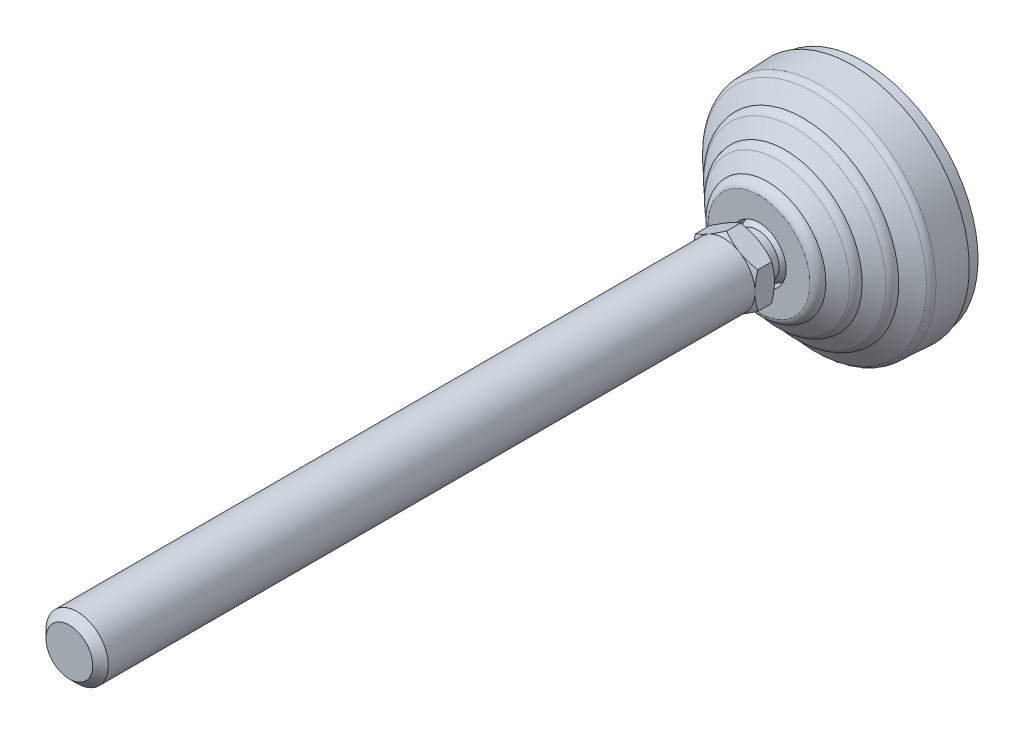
ISO-10303-21;
HEADER;
FILE_DESCRIPTION(('STEP AP214'),'2;1');
FILE_NAME('part.step','',(''),(''),'','','');
FILE_SCHEMA(('AUTOMOTIVE_DESIGN { 1 0 10303 214 1 1 1 1 }'));
ENDSEC;
DATA;
#1=APPLICATION_CONTEXT('core data for automotive mechanical design processes');
#2=APPLICATION_PROTOCOL_DEFINITION('international standard','automotive_design',2000,#1);
#3=PRODUCT_CONTEXT('',#1,'mechanical');
#4=PRODUCT('Part','Part','',(#3));
#5=PRODUCT_RELATED_PRODUCT_CATEGORY('part','',(#4));
#6=PRODUCT_DEFINITION_FORMATION('','',#4);
#7=PRODUCT_DEFINITION_CONTEXT('part definition',#1,'design');
#8=PRODUCT_DEFINITION('design','',#6,#7);
#9=PRODUCT_DEFINITION_SHAPE('','',#8);
#10=(LENGTH_UNIT() NAMED_UNIT(*) SI_UNIT(.MILLI.,.METRE.));
#11=(NAMED_UNIT(*) PLANE_ANGLE_UNIT() SI_UNIT($,.RADIAN.));
#12=(NAMED_UNIT(*) SI_UNIT($,.STERADIAN.) SOLID_ANGLE_UNIT());
#13=UNCERTAINTY_MEASURE_WITH_UNIT(LENGTH_MEASURE(1.E-05),#10,'distance_accuracy_value','');
#14=(GEOMETRIC_REPRESENTATION_CONTEXT(3) GLOBAL_UNCERTAINTY_ASSIGNED_CONTEXT((#13)) GLOBAL_UNIT_ASSIGNED_CONTEXT((#10,
#11,#12)) REPRESENTATION_CONTEXT('',''));
#15=CARTESIAN_POINT('',(0.,0.,0.));
#16=DIRECTION('',(0.,0.,1.));
#17=DIRECTION('',(1.,0.,0.));
#18=AXIS2_PLACEMENT_3D('',#15,#16,#17);
#19=CARTESIAN_POINT('',(0.,0.,35.2753734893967));
#20=DIRECTION('',(0.,0.,-1.));
#21=DIRECTION('',(0.,1.,0.));
#22=AXIS2_PLACEMENT_3D('',#19,#20,#21);
#23=CONICAL_SURFACE('',#22,9.2450899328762,1.0471975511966);
#24=CARTESIAN_POINT('',(0.,0.,36.));
#25=DIRECTION('',(0.,0.,-1.));
#26=DIRECTION('',(0.,1.,0.));
#27=AXIS2_PLACEMENT_3D('',#24,#25,#26);
#28=CIRCLE('',#27,7.99);
#29=CARTESIAN_POINT('',(0.,7.99,36.));
#30=VERTEX_POINT('',#29);
#31=EDGE_CURVE('E124',#30,#30,#28,.F.);
#32=ORIENTED_EDGE('',*,*,#31,.F.);
#33=EDGE_LOOP('',(#32));
#34=FACE_BOUND('',#33,.T.);
#35=CARTESIAN_POINT('',(-4.19327850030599E-08,-9.23760428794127,35.2796952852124));
#36=CARTESIAN_POINT('',(0.175847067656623,-9.13607893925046,35.3382996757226));
#37=CARTESIAN_POINT('',(0.352349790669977,-9.03417505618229,35.3942441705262));
#38=CARTESIAN_POINT('',(0.706788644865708,-8.82953969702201,35.5000807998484));
#39=CARTESIAN_POINT('',(0.884725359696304,-8.72680788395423,35.5499703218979));
#40=CARTESIAN_POINT('',(1.42138431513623,-8.41696768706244,35.6895770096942));
#41=CARTESIAN_POINT('',(1.78222493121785,-8.20863626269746,35.7689823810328));
#42=CARTESIAN_POINT('',(2.32221590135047,-7.896872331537,35.862092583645));
#43=CARTESIAN_POINT('',(2.49975318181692,-7.79437113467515,35.8886165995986));
#44=CARTESIAN_POINT('',(2.85563052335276,-7.58890525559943,35.9330919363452));
#45=CARTESIAN_POINT('',(3.03397051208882,-7.48594061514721,35.9510440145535));
#46=CARTESIAN_POINT('',(3.3909574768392,-7.27983409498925,35.9779205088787));
#47=CARTESIAN_POINT('',(3.56960387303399,-7.17669255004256,35.9868551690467));
#48=CARTESIAN_POINT('',(3.92706158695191,-6.97031424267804,35.9955052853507));
#49=CARTESIAN_POINT('',(4.10587289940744,-6.86707748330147,35.995221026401));
#50=CARTESIAN_POINT('',(4.44015430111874,-6.67408002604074,35.9860752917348));
#51=CARTESIAN_POINT('',(4.59564800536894,-6.58430569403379,35.9783294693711));
#52=CARTESIAN_POINT('',(4.90627121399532,-6.4049673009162,35.956016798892));
#53=CARTESIAN_POINT('',(5.06140069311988,-6.31540325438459,35.9414494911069));
#54=CARTESIAN_POINT('',(5.52618852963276,-6.04705787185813,35.8878596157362));
#55=CARTESIAN_POINT('',(5.83502420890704,-5.86875150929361,35.8389557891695));
#56=CARTESIAN_POINT('',(6.455971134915,-5.51024763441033,35.7166979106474));
#57=CARTESIAN_POINT('',(6.76800315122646,-5.33009586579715,35.6428257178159));
#58=CARTESIAN_POINT('',(7.38741452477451,-4.97247854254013,35.4751673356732));
#59=CARTESIAN_POINT('',(7.69480181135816,-4.79500840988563,35.3814205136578));
#60=CARTESIAN_POINT('',(7.9999999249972,-4.6188021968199,35.2796953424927));
#61=B_SPLINE_CURVE_WITH_KNOTS('',3,(#35,#36,#37,#38,#39,#40,#41,#42,#43,#44,#45,#46,#47,#48,#49,
#50,#51,#52,#53,#54,#55,#56,#57,#58,#59,#60),.UNSPECIFIED.,.F.,.F.,(4,2,2,2,2,2,2,2,2,2,2,2,4),
(0.,0.633965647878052,1.26820386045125,2.53931509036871,3.15930425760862,3.77923863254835,
4.39846794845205,5.01767812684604,5.55669080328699,6.09573980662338,7.17460542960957,
8.2773951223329,9.37802050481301),.UNSPECIFIED.);
#62=CARTESIAN_POINT('',(-1.44240226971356E-08,-9.23760431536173,35.2796953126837));
#63=VERTEX_POINT('',#62);
#64=CARTESIAN_POINT('',(8.,-4.61880217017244,35.2796953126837));
#65=VERTEX_POINT('',#64);
#66=EDGE_CURVE('E140',#63,#65,#61,.T.);
#67=ORIENTED_EDGE('',*,*,#66,.T.);
#68=CARTESIAN_POINT('',(7.9999999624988,-4.6188021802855,35.2796952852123));
#69=CARTESIAN_POINT('',(7.99999998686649,-4.23969380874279,35.3891659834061));
#70=CARTESIAN_POINT('',(7.999999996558,-3.85751175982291,35.4893813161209));
#71=CARTESIAN_POINT('',(8.00000000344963,-3.08693961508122,35.6664987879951));
#72=CARTESIAN_POINT('',(8.00000000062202,-2.69853763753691,35.7433487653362));
#73=CARTESIAN_POINT('',(7.99999999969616,-2.11699996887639,35.8364192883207));
#74=CARTESIAN_POINT('',(7.99999999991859,-1.92560834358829,35.8635449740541));
#75=CARTESIAN_POINT('',(8.0000000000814,-1.54193621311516,35.9104602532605));
#76=CARTESIAN_POINT('',(8.0000000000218,-1.34965578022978,35.9302504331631));
#77=CARTESIAN_POINT('',(7.99999999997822,-0.96464588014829,35.962068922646));
#78=CARTESIAN_POINT('',(7.99999999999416,-0.771917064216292,35.9741050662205));
#79=CARTESIAN_POINT('',(8.00000000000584,-0.386125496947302,35.9901838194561));
#80=CARTESIAN_POINT('',(8.00000000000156,-0.193062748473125,35.9942264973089));
#81=CARTESIAN_POINT('',(7.99999999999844,0.193062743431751,35.9942264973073));
#82=CARTESIAN_POINT('',(7.99999999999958,0.38612548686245,35.9901838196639));
#83=CARTESIAN_POINT('',(8.00000000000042,0.771917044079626,35.9741050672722));
#84=CARTESIAN_POINT('',(8.00000000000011,0.964645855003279,35.962068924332));
#85=CARTESIAN_POINT('',(7.99999999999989,1.34965574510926,35.930250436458));
#86=CARTESIAN_POINT('',(7.99999999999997,1.54193617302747,35.9104602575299));
#87=CARTESIAN_POINT('',(8.00000000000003,1.92560829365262,35.8635449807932));
#88=CARTESIAN_POINT('',(8.00000000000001,2.11699991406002,35.8364192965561));
#89=CARTESIAN_POINT('',(7.99999999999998,2.69853756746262,35.7433487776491));
#90=CARTESIAN_POINT('',(7.99999999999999,3.0869395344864,35.6664988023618));
#91=CARTESIAN_POINT('',(8.00000000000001,3.85751166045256,35.4893813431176));
#92=CARTESIAN_POINT('',(8.00000000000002,4.23969370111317,35.3891660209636));
#93=CARTESIAN_POINT('',(8.,4.61880206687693,35.2796953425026));
#94=B_SPLINE_CURVE_WITH_KNOTS('',3,(#68,#69,#70,#71,#72,#73,#74,#75,#76,#77,#78,#79,#80,#81,#82,
#83,#84,#85,#86,#87,#88,#89,#90,#91,#92,#93),.UNSPECIFIED.,.F.,.F.,(4,2,2,2,2,2,2,2,2,2,2,2,4),
(0.,1.1842935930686,2.37121196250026,2.95099639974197,3.53073447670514,4.10988591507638,
4.68903241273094,5.26817889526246,5.84733031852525,6.42706838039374,7.00685280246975,
8.19377114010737,9.37806470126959),.UNSPECIFIED.);
#95=CARTESIAN_POINT('',(8.00000001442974,4.618802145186,35.2796953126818));
#96=VERTEX_POINT('',#95);
#97=EDGE_CURVE('E132',#65,#96,#94,.T.);
#98=ORIENTED_EDGE('',*,*,#97,.T.);
#99=CARTESIAN_POINT('',(8.00000000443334,4.61880210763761,35.2796952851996));
#100=CARTESIAN_POINT('',(7.82415291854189,4.72032749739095,35.3382996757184));
#101=CARTESIAN_POINT('',(7.64765020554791,4.8222313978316,35.3942441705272));
#102=CARTESIAN_POINT('',(7.29321135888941,5.02686677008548,35.500080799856));
#103=CARTESIAN_POINT('',(7.11527464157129,5.12959857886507,35.549970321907));
#104=CARTESIAN_POINT('',(6.57861568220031,5.43943876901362,35.689577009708));
#105=CARTESIAN_POINT('',(6.21777506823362,5.6477701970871,35.7689823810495));
#106=CARTESIAN_POINT('',(5.67778409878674,5.95953412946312,35.8620925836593));
#107=CARTESIAN_POINT('',(5.50024681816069,6.06203532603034,35.8886165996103));
#108=CARTESIAN_POINT('',(5.14436947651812,6.2675012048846,35.9330919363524));
#109=CARTESIAN_POINT('',(4.96602948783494,6.37046584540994,35.9510440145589));
#110=CARTESIAN_POINT('',(4.60904252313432,6.57657236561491,35.977920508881));
#111=CARTESIAN_POINT('',(4.43039612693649,6.6797139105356,35.986855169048));
#112=CARTESIAN_POINT('',(4.0729384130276,6.88609221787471,35.9955052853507));
#113=CARTESIAN_POINT('',(3.89412710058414,6.98932897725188,35.9952210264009));
#114=CARTESIAN_POINT('',(3.55984569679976,7.18232643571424,35.9860752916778));
#115=CARTESIAN_POINT('',(3.40435199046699,7.27210076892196,35.9783294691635));
#116=CARTESIAN_POINT('',(3.09372877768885,7.45143916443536,35.956016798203));
#117=CARTESIAN_POINT('',(2.9385992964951,7.54100321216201,35.9414494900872));
#118=CARTESIAN_POINT('',(2.47381145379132,7.80934859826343,35.8878596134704));
#119=CARTESIAN_POINT('',(2.16497577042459,7.98765496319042,35.8389557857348));
#120=CARTESIAN_POINT('',(1.54402883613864,8.34615884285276,35.7166979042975));
#121=CARTESIAN_POINT('',(1.23199681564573,8.52631061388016,35.6428257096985));
#122=CARTESIAN_POINT('',(0.612585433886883,8.88392794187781,35.4751673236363));
#123=CARTESIAN_POINT('',(0.305198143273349,9.06139807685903,35.3814204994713));
#124=CARTESIAN_POINT('',(2.56600557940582E-08,9.23760429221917,35.2796953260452));
#125=B_SPLINE_CURVE_WITH_KNOTS('',3,(#99,#100,#101,#102,#103,#104,#105,#106,#107,#108,#109,#110,
#111,#112,#113,#114,#115,#116,#117,#118,#119,#120,#121,#122,#123,#124),.UNSPECIFIED.,.F.,.F.,(4,
2,2,2,2,2,2,2,2,2,2,2,4),(0.,0.63396564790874,1.26820386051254,2.53931509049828,
3.15930425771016,3.77923863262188,4.39846794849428,5.01767812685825,5.55669081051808,
6.0957398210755,7.17460545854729,8.27739516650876,9.37802056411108),.UNSPECIFIED.);
#126=CARTESIAN_POINT('',(-1.1538685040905E-08,9.23760430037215,35.279695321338));
#127=VERTEX_POINT('',#126);
#128=EDGE_CURVE('E176',#96,#127,#125,.T.);
#129=ORIENTED_EDGE('',*,*,#128,.T.);
#130=CARTESIAN_POINT('',(-1.65350869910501E-08,9.23760427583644,35.2796953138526));
#131=CARTESIAN_POINT('',(-0.175847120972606,9.13607891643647,35.3382996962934));
#132=CARTESIAN_POINT('',(-0.352349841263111,9.03417502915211,35.3942441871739));
#133=CARTESIAN_POINT('',(-0.7067886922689,8.82953966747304,35.5000808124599));
#134=CARTESIAN_POINT('',(-0.884725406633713,8.72680785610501,35.5499703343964));
#135=CARTESIAN_POINT('',(-1.42138436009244,8.41696766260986,35.6895770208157));
#136=CARTESIAN_POINT('',(-1.78222497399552,8.2086362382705,35.7689823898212));
#137=CARTESIAN_POINT('',(-2.32221594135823,7.89687230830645,35.8620925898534));
#138=CARTESIAN_POINT('',(-2.4997532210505,7.79437111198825,35.8886166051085));
#139=CARTESIAN_POINT('',(-2.85563056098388,7.58890523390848,35.9330919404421));
#140=CARTESIAN_POINT('',(-3.03397054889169,7.48594059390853,35.9510440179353));
#141=CARTESIAN_POINT('',(-3.39095751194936,7.27983407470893,35.9779205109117));
#142=CARTESIAN_POINT('',(-3.56960390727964,7.1766925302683,35.9868551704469));
#143=CARTESIAN_POINT('',(-3.92706161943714,6.97031422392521,35.9955052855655));
#144=CARTESIAN_POINT('',(-4.10587293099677,6.86707746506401,35.9952210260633));
#145=CARTESIAN_POINT('',(-4.44015433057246,6.67408000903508,35.9860752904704));
#146=CARTESIAN_POINT('',(-4.59564803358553,6.58430567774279,35.9783294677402));
#147=CARTESIAN_POINT('',(-4.90627123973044,6.40496728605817,35.956016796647));
#148=CARTESIAN_POINT('',(-5.06140071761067,6.31540324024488,35.9414494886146));
#149=CARTESIAN_POINT('',(-5.52618855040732,6.04705785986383,35.8878596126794));
#150=CARTESIAN_POINT('',(-5.83502422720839,5.8687514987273,35.8389557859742));
#151=CARTESIAN_POINT('',(-6.45597114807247,5.51024762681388,35.7166979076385));
#152=CARTESIAN_POINT('',(-6.76800316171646,5.33009585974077,35.6428257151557));
#153=CARTESIAN_POINT('',(-7.38741452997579,4.97247853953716,35.4751673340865));
#154=CARTESIAN_POINT('',(-7.69480181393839,4.7950084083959,35.381420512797));
#155=CARTESIAN_POINT('',(-7.9999999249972,4.6188021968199,35.2796953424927));
#156=B_SPLINE_CURVE_WITH_KNOTS('',3,(#130,#131,#132,#133,#134,#135,#136,#137,#138,#139,#140,
#141,#142,#143,#144,#145,#146,#147,#148,#149,#150,#151,#152,#153,#154,#155),.UNSPECIFIED.,.F.,
.F.,(4,2,2,2,2,2,2,2,2,2,2,2,4),(0.,0.633965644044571,1.26820385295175,2.53931507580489,
3.15930423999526,3.77923861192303,4.39846792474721,5.01767810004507,5.55669077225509,
6.09573977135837,7.17460538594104,8.27739506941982,9.37802044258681),.UNSPECIFIED.);
#157=CARTESIAN_POINT('',(-8.,4.61880217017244,35.2796953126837));
#158=VERTEX_POINT('',#157);
#159=EDGE_CURVE('E168',#127,#158,#156,.T.);
#160=ORIENTED_EDGE('',*,*,#159,.T.);
#161=CARTESIAN_POINT('',(-7.9999999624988,4.6188021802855,35.2796952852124));
#162=CARTESIAN_POINT('',(-7.99999998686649,4.23969380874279,35.3891659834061));
#163=CARTESIAN_POINT('',(-7.999999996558,3.8575117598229,35.4893813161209));
#164=CARTESIAN_POINT('',(-8.00000000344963,3.08693961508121,35.6664987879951));
#165=CARTESIAN_POINT('',(-8.00000000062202,2.69853763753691,35.7433487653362));
#166=CARTESIAN_POINT('',(-7.99999999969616,2.11699996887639,35.8364192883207));
#167=CARTESIAN_POINT('',(-7.99999999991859,1.92560834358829,35.8635449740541));
#168=CARTESIAN_POINT('',(-8.0000000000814,1.54193621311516,35.9104602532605));
#169=CARTESIAN_POINT('',(-8.0000000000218,1.34965578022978,35.9302504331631));
#170=CARTESIAN_POINT('',(-7.99999999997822,0.964645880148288,35.962068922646));
#171=CARTESIAN_POINT('',(-7.99999999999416,0.77191706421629,35.9741050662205));
#172=CARTESIAN_POINT('',(-8.00000000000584,0.386125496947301,35.9901838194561));
#173=CARTESIAN_POINT('',(-8.00000000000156,0.193062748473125,35.9942264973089));
#174=CARTESIAN_POINT('',(-7.99999999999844,-0.193062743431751,35.9942264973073));
#175=CARTESIAN_POINT('',(-7.99999999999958,-0.38612548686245,35.9901838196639));
#176=CARTESIAN_POINT('',(-8.00000000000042,-0.771917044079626,35.9741050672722));
#177=CARTESIAN_POINT('',(-8.00000000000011,-0.964645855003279,35.962068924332));
#178=CARTESIAN_POINT('',(-7.99999999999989,-1.34965574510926,35.930250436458));
#179=CARTESIAN_POINT('',(-7.99999999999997,-1.54193617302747,35.9104602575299));
#180=CARTESIAN_POINT('',(-8.00000000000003,-1.92560829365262,35.8635449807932));
#181=CARTESIAN_POINT('',(-8.00000000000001,-2.11699991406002,35.8364192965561));
#182=CARTESIAN_POINT('',(-7.99999999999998,-2.69853756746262,35.7433487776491));
#183=CARTESIAN_POINT('',(-7.99999999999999,-3.0869395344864,35.6664988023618));
#184=CARTESIAN_POINT('',(-8.00000000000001,-3.85751166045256,35.4893813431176));
#185=CARTESIAN_POINT('',(-8.00000000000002,-4.23969370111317,35.3891660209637));
#186=CARTESIAN_POINT('',(-8.,-4.61880206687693,35.2796953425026));
#187=B_SPLINE_CURVE_WITH_KNOTS('',3,(#161,#162,#163,#164,#165,#166,#167,#168,#169,#170,#171,
#172,#173,#174,#175,#176,#177,#178,#179,#180,#181,#182,#183,#184,#185,#186),.UNSPECIFIED.,.F.,
.F.,(4,2,2,2,2,2,2,2,2,2,2,2,4),(0.,1.1842935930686,2.37121196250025,2.95099639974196,
3.53073447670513,4.10988591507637,4.68903241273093,5.26817889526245,5.84733031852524,
6.42706838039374,7.00685280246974,8.19377114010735,9.37806470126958),.UNSPECIFIED.);
#188=CARTESIAN_POINT('',(-8.00000001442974,-4.61880214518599,35.2796953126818));
#189=VERTEX_POINT('',#188);
#190=EDGE_CURVE('E358',#158,#189,#187,.T.);
#191=ORIENTED_EDGE('',*,*,#190,.T.);
#192=CARTESIAN_POINT('',(-8.00000000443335,-4.61880210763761,35.2796952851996));
#193=CARTESIAN_POINT('',(-7.82415291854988,-4.72032749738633,35.3382996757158));
#194=CARTESIAN_POINT('',(-7.64765020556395,-4.82223139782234,35.3942441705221));
#195=CARTESIAN_POINT('',(-7.29321135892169,-5.02686677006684,35.5000807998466));
#196=CARTESIAN_POINT('',(-7.11527464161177,-5.1295985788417,35.5499703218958));
#197=CARTESIAN_POINT('',(-6.57861568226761,-5.43943876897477,35.6895770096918));
#198=CARTESIAN_POINT('',(-6.21777506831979,-5.64777019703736,35.7689823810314));
#199=CARTESIAN_POINT('',(-5.67778409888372,-5.95953412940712,35.8620925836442));
#200=CARTESIAN_POINT('',(-5.50024681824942,-6.06203532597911,35.8886165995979));
#201=CARTESIAN_POINT('',(-5.14436947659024,-6.26750120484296,35.9330919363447));
#202=CARTESIAN_POINT('',(-4.9660294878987,-6.37046584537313,35.9510440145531));
#203=CARTESIAN_POINT('',(-4.60904252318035,-6.57657236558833,35.9779205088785));
#204=CARTESIAN_POINT('',(-4.43039612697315,-6.67971391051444,35.9868551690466));
#205=CARTESIAN_POINT('',(-4.07293841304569,-6.88609221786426,35.9955052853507));
#206=CARTESIAN_POINT('',(-3.89412710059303,-6.98932897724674,35.995221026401));
#207=CARTESIAN_POINT('',(-3.55984569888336,-7.18232643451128,35.9860752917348));
#208=CARTESIAN_POINT('',(-3.40435199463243,-7.27210076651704,35.9783294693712));
#209=CARTESIAN_POINT('',(-3.09372878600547,-7.45143915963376,35.9560167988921));
#210=CARTESIAN_POINT('',(-2.93859930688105,-7.54100320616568,35.941449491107));
#211=CARTESIAN_POINT('',(-2.47381147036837,-7.80934858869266,35.8878596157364));
#212=CARTESIAN_POINT('',(-2.16497579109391,-7.98765495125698,35.8389557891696));
#213=CARTESIAN_POINT('',(-1.54402886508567,-8.34615882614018,35.7166979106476));
#214=CARTESIAN_POINT('',(-1.23199684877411,-8.52631059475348,35.642825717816));
#215=CARTESIAN_POINT('',(-0.612585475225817,-8.88392791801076,35.4751673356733));
#216=CARTESIAN_POINT('',(-0.305198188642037,-9.06139805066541,35.3814205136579));
#217=CARTESIAN_POINT('',(-7.50027841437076E-08,-9.23760426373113,35.2796953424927));
#218=B_SPLINE_CURVE_WITH_KNOTS('',3,(#192,#193,#194,#195,#196,#197,#198,#199,#200,#201,#202,
#203,#204,#205,#206,#207,#208,#209,#210,#211,#212,#213,#214,#215,#216,#217),.UNSPECIFIED.,.F.,
.F.,(4,2,2,2,2,2,2,2,2,2,2,2,4),(0.,0.633965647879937,1.26820386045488,2.53931509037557,
3.15930425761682,3.77923863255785,4.39846794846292,5.01767812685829,5.55669080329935,
6.09573980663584,7.17460542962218,8.27739512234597,9.37802050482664),.UNSPECIFIED.);
#219=EDGE_CURVE('E158',#189,#63,#218,.T.);
#220=ORIENTED_EDGE('',*,*,#219,.T.);
#221=EDGE_LOOP('',(#67,#98,#129,#160,#191,#220));
#222=FACE_BOUND('',#221,.T.);
#223=ADVANCED_FACE('F14',(#34,#222),#23,.T.);
#224=CARTESIAN_POINT('',(0.,-9.23760430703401,36.1));
#225=DIRECTION('',(0.5,0.866025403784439,0.));
#226=DIRECTION('',(-0.866025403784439,0.5,0.));
#227=AXIS2_PLACEMENT_3D('',#224,#225,#226);
#228=PLANE('',#227);
#229=DIRECTION('',(0.,0.,1.));
#230=VECTOR('',#229,1.);
#231=CARTESIAN_POINT('',(0.,-9.23760430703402,36.1));
#232=LINE('',#231,#230);
#233=CARTESIAN_POINT('',(0.,-9.23760430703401,31.7203046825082));
#234=VERTEX_POINT('',#233);
#235=EDGE_CURVE('E339',#234,#63,#232,.T.);
#236=ORIENTED_EDGE('',*,*,#235,.T.);
#237=ORIENTED_EDGE('',*,*,#219,.F.);
#238=DIRECTION('',(0.,0.,1.));
#239=VECTOR('',#238,1.);
#240=CARTESIAN_POINT('',(-8.,-4.61880215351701,36.1));
#241=LINE('',#240,#239);
#242=CARTESIAN_POINT('',(-8.,-4.61880215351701,31.7203046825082));
#243=VERTEX_POINT('',#242);
#244=EDGE_CURVE('E342',#243,#189,#241,.T.);
#245=ORIENTED_EDGE('',*,*,#244,.F.);
#246=CARTESIAN_POINT('',(0.,-9.23760430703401,31.7203046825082));
#247=CARTESIAN_POINT('',(-0.175847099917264,-9.13607893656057,31.6617003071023));
#248=CARTESIAN_POINT('',(-0.352349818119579,-9.03417504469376,31.6057558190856));
#249=CARTESIAN_POINT('',(-0.706788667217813,-8.82953967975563,31.4999191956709));
#250=CARTESIAN_POINT('',(-0.884725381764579,-8.72680786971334,31.4500296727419));
#251=CARTESIAN_POINT('',(-1.42138433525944,-8.41696767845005,31.3104229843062));
#252=CARTESIAN_POINT('',(-1.78222494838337,-8.20863625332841,31.2310176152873));
#253=CARTESIAN_POINT('',(-2.32221591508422,-7.8968723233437,31.1379074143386));
#254=CARTESIAN_POINT('',(-2.49975319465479,-7.79437112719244,31.1113833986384));
#255=CARTESIAN_POINT('',(-2.85563053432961,-7.5889052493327,31.0669080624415));
#256=CARTESIAN_POINT('',(-3.03397052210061,-7.48594060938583,31.0489559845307));
#257=CARTESIAN_POINT('',(-3.39095748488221,-7.27983409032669,31.0220794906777));
#258=CARTESIAN_POINT('',(-3.56960388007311,-7.17669254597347,31.0131448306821));
#259=CARTESIAN_POINT('',(-3.9270615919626,-6.97031423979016,31.0044947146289));
#260=CARTESIAN_POINT('',(-4.10587290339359,-6.86707748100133,31.0047789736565));
#261=CARTESIAN_POINT('',(-4.44015430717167,-6.67408002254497,31.0139247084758));
#262=CARTESIAN_POINT('',(-4.59564801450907,-6.58430568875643,31.0216705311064));
#263=CARTESIAN_POINT('',(-4.90627122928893,-6.40496729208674,31.0439832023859));
#264=CARTESIAN_POINT('',(-5.06140071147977,-6.3154032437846,31.0585505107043));
#265=CARTESIAN_POINT('',(-5.52618855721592,-6.04705785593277,31.1121403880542));
#266=CARTESIAN_POINT('',(-5.83502424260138,-5.86875148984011,31.161044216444));
#267=CARTESIAN_POINT('',(-6.4559711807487,-5.51024760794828,31.283302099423));
#268=CARTESIAN_POINT('',(-6.76800320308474,-5.33009583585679,31.3571742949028));
#269=CARTESIAN_POINT('',(-7.38741458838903,-4.97247850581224,31.5248326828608));
#270=CARTESIAN_POINT('',(-7.69480188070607,-4.79500836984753,31.6185795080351));
#271=CARTESIAN_POINT('',(-8.,-4.61880215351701,31.7203046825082));
#272=B_SPLINE_CURVE_WITH_KNOTS('',3,(#246,#247,#248,#249,#250,#251,#252,#253,#254,#255,#256,
#257,#258,#259,#260,#261,#262,#263,#264,#265,#266,#267,#268,#269,#270,#271),.UNSPECIFIED.,.F.,
.F.,(4,2,2,2,2,2,2,2,2,2,2,2,4),(0.,0.633965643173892,1.26820385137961,2.53931507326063,
3.15930423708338,3.77923860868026,4.39846792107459,5.01767809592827,5.55669078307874,
6.09573979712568,7.17460544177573,8.27739515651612,9.37802056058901),.UNSPECIFIED.);
#273=EDGE_CURVE('E341',#234,#243,#272,.T.);
#274=ORIENTED_EDGE('',*,*,#273,.F.);
#275=EDGE_LOOP('',(#236,#237,#245,#274));
#276=FACE_BOUND('',#275,.T.);
#277=ADVANCED_FACE('F152',(#276),#228,.F.);
#278=CARTESIAN_POINT('',(8.,-4.61880215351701,36.1));
#279=DIRECTION('',(-0.5,0.866025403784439,0.));
#280=DIRECTION('',(-0.866025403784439,-0.5,0.));
#281=AXIS2_PLACEMENT_3D('',#278,#279,#280);
#282=PLANE('',#281);
#283=DIRECTION('',(0.,0.,1.));
#284=VECTOR('',#283,1.);
#285=CARTESIAN_POINT('',(8.,-4.61880215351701,36.1));
#286=LINE('',#285,#284);
#287=CARTESIAN_POINT('',(8.,-4.61880215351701,31.7203046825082));
#288=VERTEX_POINT('',#287);
#289=EDGE_CURVE('E31',#288,#65,#286,.T.);
#290=ORIENTED_EDGE('',*,*,#289,.T.);
#291=ORIENTED_EDGE('',*,*,#66,.F.);
#292=ORIENTED_EDGE('',*,*,#235,.F.);
#293=CARTESIAN_POINT('',(8.,-4.61880215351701,31.7203046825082));
#294=CARTESIAN_POINT('',(7.82415290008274,-4.72032752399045,31.6617003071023));
#295=CARTESIAN_POINT('',(7.64765018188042,-4.82223141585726,31.6057558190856));
#296=CARTESIAN_POINT('',(7.29321133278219,-5.02686678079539,31.4999191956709));
#297=CARTESIAN_POINT('',(7.11527461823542,-5.12959859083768,31.4500296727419));
#298=CARTESIAN_POINT('',(6.57861566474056,-5.43943878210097,31.3104229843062));
#299=CARTESIAN_POINT('',(6.21777505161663,-5.64777020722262,31.2310176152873));
#300=CARTESIAN_POINT('',(5.67778408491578,-5.95953413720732,31.1379074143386));
#301=CARTESIAN_POINT('',(5.5002468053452,-6.06203533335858,31.1113833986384));
#302=CARTESIAN_POINT('',(5.14436946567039,-6.26750121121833,31.0669080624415));
#303=CARTESIAN_POINT('',(4.96602947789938,-6.37046585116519,31.0489559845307));
#304=CARTESIAN_POINT('',(4.60904251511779,-6.57657237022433,31.0220794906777));
#305=CARTESIAN_POINT('',(4.43039611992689,-6.67971391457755,31.0131448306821));
#306=CARTESIAN_POINT('',(4.0729384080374,-6.88609222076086,31.0044947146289));
#307=CARTESIAN_POINT('',(3.8941270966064,-6.98932897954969,31.0047789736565));
#308=CARTESIAN_POINT('',(3.55984569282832,-7.18232643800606,31.0139247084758));
#309=CARTESIAN_POINT('',(3.40435198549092,-7.27210077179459,31.0216705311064));
#310=CARTESIAN_POINT('',(3.09372877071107,-7.45143916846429,31.0439832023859));
#311=CARTESIAN_POINT('',(2.93859928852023,-7.54100321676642,31.0585505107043));
#312=CARTESIAN_POINT('',(2.47381144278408,-7.80934860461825,31.1121403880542));
#313=CARTESIAN_POINT('',(2.16497575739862,-7.98765497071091,31.161044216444));
#314=CARTESIAN_POINT('',(1.5440288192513,-8.34615885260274,31.283302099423));
#315=CARTESIAN_POINT('',(1.23199679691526,-8.52631062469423,31.3571742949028));
#316=CARTESIAN_POINT('',(0.612585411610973,-8.88392795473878,31.5248326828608));
#317=CARTESIAN_POINT('',(0.305198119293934,-9.0613980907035,31.6185795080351));
#318=CARTESIAN_POINT('',(0.,-9.23760430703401,31.7203046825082));
#319=B_SPLINE_CURVE_WITH_KNOTS('',3,(#293,#294,#295,#296,#297,#298,#299,#300,#301,#302,#303,
#304,#305,#306,#307,#308,#309,#310,#311,#312,#313,#314,#315,#316,#317,#318),.UNSPECIFIED.,.F.,
.F.,(4,2,2,2,2,2,2,2,2,2,2,2,4),(0.,0.633965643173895,1.26820385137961,2.53931507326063,
3.15930423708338,3.77923860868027,4.3984679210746,5.01767809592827,5.55669078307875,
6.09573979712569,7.17460544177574,8.27739515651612,9.37802056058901),.UNSPECIFIED.);
#320=EDGE_CURVE('E338',#288,#234,#319,.T.);
#321=ORIENTED_EDGE('',*,*,#320,.F.);
#322=EDGE_LOOP('',(#290,#291,#292,#321));
#323=FACE_BOUND('',#322,.T.);
#324=ADVANCED_FACE('F365',(#323),#282,.F.);
#325=CARTESIAN_POINT('',(-8.,4.61880215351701,36.1));
#326=DIRECTION('',(0.5,-0.866025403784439,0.));
#327=DIRECTION('',(0.866025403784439,0.5,0.));
#328=AXIS2_PLACEMENT_3D('',#325,#326,#327);
#329=PLANE('',#328);
#330=DIRECTION('',(0.,0.,1.));
#331=VECTOR('',#330,1.);
#332=CARTESIAN_POINT('',(-8.,4.61880215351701,36.1));
#333=LINE('',#332,#331);
#334=CARTESIAN_POINT('',(-8.,4.61880215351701,31.7203046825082));
#335=VERTEX_POINT('',#334);
#336=EDGE_CURVE('E345',#335,#158,#333,.T.);
#337=ORIENTED_EDGE('',*,*,#336,.T.);
#338=ORIENTED_EDGE('',*,*,#159,.F.);
#339=DIRECTION('',(0.,0.,1.));
#340=VECTOR('',#339,1.);
#341=CARTESIAN_POINT('',(0.,9.23760430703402,36.1));
#342=LINE('',#341,#340);
#343=CARTESIAN_POINT('',(0.,9.23760430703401,31.7203046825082));
#344=VERTEX_POINT('',#343);
#345=EDGE_CURVE('E207',#344,#127,#342,.T.);
#346=ORIENTED_EDGE('',*,*,#345,.F.);
#347=CARTESIAN_POINT('',(-8.,4.61880215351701,31.7203046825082));
#348=CARTESIAN_POINT('',(-7.82415290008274,4.72032752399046,31.6617003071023));
#349=CARTESIAN_POINT('',(-7.64765018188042,4.82223141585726,31.6057558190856));
#350=CARTESIAN_POINT('',(-7.29321133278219,5.02686678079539,31.4999191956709));
#351=CARTESIAN_POINT('',(-7.11527461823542,5.12959859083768,31.4500296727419));
#352=CARTESIAN_POINT('',(-6.57861566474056,5.43943878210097,31.3104229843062));
#353=CARTESIAN_POINT('',(-6.21777505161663,5.64777020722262,31.2310176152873));
#354=CARTESIAN_POINT('',(-5.67778408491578,5.95953413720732,31.1379074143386));
#355=CARTESIAN_POINT('',(-5.50024680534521,6.06203533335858,31.1113833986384));
#356=CARTESIAN_POINT('',(-5.14436946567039,6.26750121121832,31.0669080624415));
#357=CARTESIAN_POINT('',(-4.96602947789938,6.37046585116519,31.0489559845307));
#358=CARTESIAN_POINT('',(-4.60904251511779,6.57657237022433,31.0220794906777));
#359=CARTESIAN_POINT('',(-4.43039611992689,6.67971391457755,31.0131448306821));
#360=CARTESIAN_POINT('',(-4.07293840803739,6.88609222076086,31.0044947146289));
#361=CARTESIAN_POINT('',(-3.8941270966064,6.98932897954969,31.0047789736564));
#362=CARTESIAN_POINT('',(-3.55984569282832,7.18232643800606,31.0139247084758));
#363=CARTESIAN_POINT('',(-3.40435198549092,7.27210077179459,31.0216705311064));
#364=CARTESIAN_POINT('',(-3.09372877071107,7.45143916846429,31.0439832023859));
#365=CARTESIAN_POINT('',(-2.93859928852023,7.54100321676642,31.0585505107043));
#366=CARTESIAN_POINT('',(-2.47381144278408,7.80934860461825,31.1121403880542));
#367=CARTESIAN_POINT('',(-2.16497575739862,7.98765497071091,31.161044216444));
#368=CARTESIAN_POINT('',(-1.5440288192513,8.34615885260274,31.2833020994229));
#369=CARTESIAN_POINT('',(-1.23199679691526,8.52631062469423,31.3571742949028));
#370=CARTESIAN_POINT('',(-0.612585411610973,8.88392795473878,31.5248326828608));
#371=CARTESIAN_POINT('',(-0.305198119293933,9.06139809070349,31.6185795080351));
#372=CARTESIAN_POINT('',(0.,9.23760430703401,31.7203046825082));
#373=B_SPLINE_CURVE_WITH_KNOTS('',3,(#347,#348,#349,#350,#351,#352,#353,#354,#355,#356,#357,
#358,#359,#360,#361,#362,#363,#364,#365,#366,#367,#368,#369,#370,#371,#372),.UNSPECIFIED.,.F.,
.F.,(4,2,2,2,2,2,2,2,2,2,2,2,4),(0.,0.633965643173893,1.26820385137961,2.53931507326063,
3.15930423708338,3.77923860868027,4.3984679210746,5.01767809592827,5.55669078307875,
6.09573979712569,7.17460544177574,8.27739515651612,9.37802056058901),.UNSPECIFIED.);
#374=EDGE_CURVE('E209',#335,#344,#373,.T.);
#375=ORIENTED_EDGE('',*,*,#374,.F.);
#376=EDGE_LOOP('',(#337,#338,#346,#375));
#377=FACE_BOUND('',#376,.T.);
#378=ADVANCED_FACE('F195',(#377),#329,.F.);
#379=CARTESIAN_POINT('',(-8.,-4.61880215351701,36.1));
#380=DIRECTION('',(1.,0.,0.));
#381=DIRECTION('',(0.,1.,0.));
#382=AXIS2_PLACEMENT_3D('',#379,#380,#381);
#383=PLANE('',#382);
#384=ORIENTED_EDGE('',*,*,#244,.T.);
#385=ORIENTED_EDGE('',*,*,#190,.F.);
#386=ORIENTED_EDGE('',*,*,#336,.F.);
#387=CARTESIAN_POINT('',(-8.,-4.618802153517,31.7203046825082));
#388=CARTESIAN_POINT('',(-8.,-4.23969378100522,31.610834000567));
#389=CARTESIAN_POINT('',(-8.,-3.85751173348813,31.5106186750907));
#390=CARTESIAN_POINT('',(-8.,-3.08693959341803,31.3335012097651));
#391=CARTESIAN_POINT('',(-8.,-2.69853761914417,31.2566512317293));
#392=CARTESIAN_POINT('',(-8.,-2.11699995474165,31.163580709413));
#393=CARTESIAN_POINT('',(-8.,-1.92560833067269,31.1364550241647));
#394=CARTESIAN_POINT('',(-8.,-1.54193620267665,31.089539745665));
#395=CARTESIAN_POINT('',(-8.,-1.3496557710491,31.069749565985));
#396=CARTESIAN_POINT('',(-8.,-0.964645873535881,31.0379310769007));
#397=CARTESIAN_POINT('',(-8.,-0.771917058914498,31.0258949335));
#398=CARTESIAN_POINT('',(-8.,-0.386125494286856,31.0098161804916));
#399=CARTESIAN_POINT('',(-8.,-0.193062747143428,31.0057735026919));
#400=CARTESIAN_POINT('',(-8.,0.193062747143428,31.0057735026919));
#401=CARTESIAN_POINT('',(-8.,0.386125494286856,31.0098161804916));
#402=CARTESIAN_POINT('',(-8.,0.771917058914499,31.0258949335));
#403=CARTESIAN_POINT('',(-8.,0.964645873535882,31.0379310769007));
#404=CARTESIAN_POINT('',(-8.,1.3496557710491,31.069749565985));
#405=CARTESIAN_POINT('',(-8.,1.54193620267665,31.089539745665));
#406=CARTESIAN_POINT('',(-8.,1.9256083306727,31.1364550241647));
#407=CARTESIAN_POINT('',(-8.,2.11699995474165,31.163580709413));
#408=CARTESIAN_POINT('',(-8.,2.69853761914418,31.2566512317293));
#409=CARTESIAN_POINT('',(-8.,3.08693959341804,31.3335012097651));
#410=CARTESIAN_POINT('',(-8.,3.85751173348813,31.5106186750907));
#411=CARTESIAN_POINT('',(-8.,4.23969378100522,31.610834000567));
#412=CARTESIAN_POINT('',(-8.,4.61880215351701,31.7203046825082));
#413=B_SPLINE_CURVE_WITH_KNOTS('',3,(#387,#388,#389,#390,#391,#392,#393,#394,#395,#396,#397,
#398,#399,#400,#401,#402,#403,#404,#405,#406,#407,#408,#409,#410,#411,#412),.UNSPECIFIED.,.F.,
.F.,(4,2,2,2,2,2,2,2,2,2,2,2,4),(0.,1.18429358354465,2.37121194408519,2.95099637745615,
3.53073445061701,4.10988588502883,4.68903237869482,5.26817887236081,5.84733030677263,
6.42706837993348,7.00685281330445,8.19377117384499,9.37806475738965),.UNSPECIFIED.);
#414=EDGE_CURVE('E344',#243,#335,#413,.T.);
#415=ORIENTED_EDGE('',*,*,#414,.F.);
#416=EDGE_LOOP('',(#384,#385,#386,#415));
#417=FACE_BOUND('',#416,.T.);
#418=ADVANCED_FACE('F381',(#417),#383,.F.);
#419=CARTESIAN_POINT('',(8.,4.61880215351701,36.1));
#420=DIRECTION('',(-1.,0.,0.));
#421=DIRECTION('',(0.,-1.,0.));
#422=AXIS2_PLACEMENT_3D('',#419,#420,#421);
#423=PLANE('',#422);
#424=DIRECTION('',(0.,0.,1.));
#425=VECTOR('',#424,1.);
#426=CARTESIAN_POINT('',(8.,4.61880215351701,36.1));
#427=LINE('',#426,#425);
#428=CARTESIAN_POINT('',(8.,4.61880215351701,31.7203046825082));
#429=VERTEX_POINT('',#428);
#430=EDGE_CURVE('E335',#96,#429,#427,.F.);
#431=ORIENTED_EDGE('',*,*,#430,.F.);
#432=ORIENTED_EDGE('',*,*,#97,.F.);
#433=ORIENTED_EDGE('',*,*,#289,.F.);
#434=CARTESIAN_POINT('',(8.,4.618802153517,31.7203046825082));
#435=CARTESIAN_POINT('',(8.,4.23969378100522,31.610834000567));
#436=CARTESIAN_POINT('',(8.,3.85751173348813,31.5106186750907));
#437=CARTESIAN_POINT('',(8.,3.08693959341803,31.3335012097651));
#438=CARTESIAN_POINT('',(8.,2.69853761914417,31.2566512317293));
#439=CARTESIAN_POINT('',(8.,2.11699995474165,31.163580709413));
#440=CARTESIAN_POINT('',(8.,1.92560833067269,31.1364550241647));
#441=CARTESIAN_POINT('',(8.,1.54193620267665,31.089539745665));
#442=CARTESIAN_POINT('',(8.,1.3496557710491,31.069749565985));
#443=CARTESIAN_POINT('',(8.,0.964645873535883,31.0379310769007));
#444=CARTESIAN_POINT('',(8.,0.7719170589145,31.0258949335));
#445=CARTESIAN_POINT('',(8.,0.386125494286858,31.0098161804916));
#446=CARTESIAN_POINT('',(8.,0.19306274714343,31.0057735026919));
#447=CARTESIAN_POINT('',(8.,-0.193062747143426,31.0057735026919));
#448=CARTESIAN_POINT('',(8.,-0.386125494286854,31.0098161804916));
#449=CARTESIAN_POINT('',(8.,-0.771917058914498,31.0258949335));
#450=CARTESIAN_POINT('',(8.,-0.96464587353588,31.0379310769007));
#451=CARTESIAN_POINT('',(8.,-1.3496557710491,31.069749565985));
#452=CARTESIAN_POINT('',(8.,-1.54193620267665,31.089539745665));
#453=CARTESIAN_POINT('',(8.,-1.9256083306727,31.1364550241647));
#454=CARTESIAN_POINT('',(8.,-2.11699995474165,31.163580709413));
#455=CARTESIAN_POINT('',(8.,-2.69853761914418,31.2566512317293));
#456=CARTESIAN_POINT('',(8.,-3.08693959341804,31.3335012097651));
#457=CARTESIAN_POINT('',(8.,-3.85751173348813,31.5106186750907));
#458=CARTESIAN_POINT('',(8.,-4.23969378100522,31.610834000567));
#459=CARTESIAN_POINT('',(8.,-4.61880215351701,31.7203046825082));
#460=B_SPLINE_CURVE_WITH_KNOTS('',3,(#434,#435,#436,#437,#438,#439,#440,#441,#442,#443,#444,
#445,#446,#447,#448,#449,#450,#451,#452,#453,#454,#455,#456,#457,#458,#459),.UNSPECIFIED.,.F.,
.F.,(4,2,2,2,2,2,2,2,2,2,2,2,4),(0.,1.18429358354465,2.37121194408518,2.95099637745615,
3.53073445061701,4.10988588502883,4.68903237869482,5.26817887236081,5.84733030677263,
6.42706837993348,7.00685281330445,8.193771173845,9.37806475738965),.UNSPECIFIED.);
#461=EDGE_CURVE('E184',#429,#288,#460,.T.);
#462=ORIENTED_EDGE('',*,*,#461,.F.);
#463=EDGE_LOOP('',(#431,#432,#433,#462));
#464=FACE_BOUND('',#463,.T.);
#465=ADVANCED_FACE('F147',(#464),#423,.F.);
#466=CARTESIAN_POINT('',(0.,9.23760430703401,36.1));
#467=DIRECTION('',(-0.5,-0.866025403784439,0.));
#468=DIRECTION('',(0.866025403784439,-0.5,0.));
#469=AXIS2_PLACEMENT_3D('',#466,#467,#468);
#470=PLANE('',#469);
#471=ORIENTED_EDGE('',*,*,#345,.T.);
#472=ORIENTED_EDGE('',*,*,#128,.F.);
#473=ORIENTED_EDGE('',*,*,#430,.T.);
#474=CARTESIAN_POINT('',(0.,9.23760430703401,31.7203046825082));
#475=CARTESIAN_POINT('',(0.175847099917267,9.13607893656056,31.6617003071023));
#476=CARTESIAN_POINT('',(0.352349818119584,9.03417504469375,31.6057558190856));
#477=CARTESIAN_POINT('',(0.706788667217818,8.82953967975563,31.4999191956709));
#478=CARTESIAN_POINT('',(0.884725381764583,8.72680786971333,31.4500296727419));
#479=CARTESIAN_POINT('',(1.42138433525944,8.41696767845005,31.3104229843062));
#480=CARTESIAN_POINT('',(1.78222494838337,8.20863625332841,31.2310176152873));
#481=CARTESIAN_POINT('',(2.32221591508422,7.8968723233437,31.1379074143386));
#482=CARTESIAN_POINT('',(2.4997531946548,7.79437112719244,31.1113833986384));
#483=CARTESIAN_POINT('',(2.85563053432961,7.5889052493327,31.0669080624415));
#484=CARTESIAN_POINT('',(3.03397052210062,7.48594060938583,31.0489559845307));
#485=CARTESIAN_POINT('',(3.39095748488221,7.27983409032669,31.0220794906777));
#486=CARTESIAN_POINT('',(3.56960388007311,7.17669254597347,31.0131448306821));
#487=CARTESIAN_POINT('',(3.92706159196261,6.97031423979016,31.0044947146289));
#488=CARTESIAN_POINT('',(4.1058729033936,6.86707748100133,31.0047789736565));
#489=CARTESIAN_POINT('',(4.44015430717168,6.67408002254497,31.0139247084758));
#490=CARTESIAN_POINT('',(4.59564801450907,6.58430568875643,31.0216705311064));
#491=CARTESIAN_POINT('',(4.90627122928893,6.40496729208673,31.0439832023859));
#492=CARTESIAN_POINT('',(5.06140071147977,6.3154032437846,31.0585505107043));
#493=CARTESIAN_POINT('',(5.52618855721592,6.04705785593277,31.1121403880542));
#494=CARTESIAN_POINT('',(5.83502424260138,5.86875148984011,31.161044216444));
#495=CARTESIAN_POINT('',(6.4559711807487,5.51024760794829,31.2833020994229));
#496=CARTESIAN_POINT('',(6.76800320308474,5.33009583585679,31.3571742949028));
#497=CARTESIAN_POINT('',(7.38741458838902,4.97247850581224,31.5248326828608));
#498=CARTESIAN_POINT('',(7.69480188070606,4.79500836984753,31.6185795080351));
#499=CARTESIAN_POINT('',(8.,4.61880215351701,31.7203046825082));
#500=B_SPLINE_CURVE_WITH_KNOTS('',3,(#474,#475,#476,#477,#478,#479,#480,#481,#482,#483,#484,
#485,#486,#487,#488,#489,#490,#491,#492,#493,#494,#495,#496,#497,#498,#499),.UNSPECIFIED.,.F.,
.F.,(4,2,2,2,2,2,2,2,2,2,2,2,4),(0.,0.633965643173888,1.2682038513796,2.53931507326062,
3.15930423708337,3.77923860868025,4.39846792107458,5.01767809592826,5.55669078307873,
6.09573979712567,7.17460544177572,8.2773951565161,9.37802056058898),.UNSPECIFIED.);
#501=EDGE_CURVE('E68',#344,#429,#500,.T.);
#502=ORIENTED_EDGE('',*,*,#501,.F.);
#503=EDGE_LOOP('',(#471,#472,#473,#502));
#504=FACE_BOUND('',#503,.T.);
#505=ADVANCED_FACE('F191',(#504),#470,.F.);
#506=CARTESIAN_POINT('',(0.,0.,31.7246265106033));
#507=DIRECTION('',(0.,0.,1.));
#508=DIRECTION('',(0.,-1.,0.));
#509=AXIS2_PLACEMENT_3D('',#506,#507,#508);
#510=CONICAL_SURFACE('',#509,9.24508993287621,1.0471975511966);
#511=CARTESIAN_POINT('',(0.,0.,31.));
#512=DIRECTION('',(0.,0.,1.));
#513=DIRECTION('',(0.,-1.,0.));
#514=AXIS2_PLACEMENT_3D('',#511,#512,#513);
#515=CIRCLE('',#514,7.99);
#516=CARTESIAN_POINT('',(0.,-7.99,31.));
#517=VERTEX_POINT('',#516);
#518=EDGE_CURVE('E208',#517,#517,#515,.T.);
#519=ORIENTED_EDGE('',*,*,#518,.T.);
#520=EDGE_LOOP('',(#519));
#521=FACE_BOUND('',#520,.T.);
#522=ORIENTED_EDGE('',*,*,#501,.T.);
#523=ORIENTED_EDGE('',*,*,#461,.T.);
#524=ORIENTED_EDGE('',*,*,#320,.T.);
#525=ORIENTED_EDGE('',*,*,#273,.T.);
#526=ORIENTED_EDGE('',*,*,#414,.T.);
#527=ORIENTED_EDGE('',*,*,#374,.T.);
#528=EDGE_LOOP('',(#522,#523,#524,#525,#526,#527));
#529=FACE_BOUND('',#528,.T.);
#530=ADVANCED_FACE('F194',(#521,#529),#510,.T.);
#531=CARTESIAN_POINT('',(6.745,0.,31.));
#532=DIRECTION('',(0.,0.,-1.));
#533=DIRECTION('',(1.,0.,0.));
#534=AXIS2_PLACEMENT_3D('',#531,#532,#533);
#535=PLANE('',#534);
#536=CARTESIAN_POINT('',(0.,0.,31.));
#537=DIRECTION('',(0.,0.,-1.));
#538=DIRECTION('',(0.,1.,0.));
#539=AXIS2_PLACEMENT_3D('',#536,#537,#538);
#540=CIRCLE('',#539,5.5);
#541=CARTESIAN_POINT('',(0.,5.5,31.));
#542=VERTEX_POINT('',#541);
#543=EDGE_CURVE('E217',#542,#542,#540,.F.);
#544=ORIENTED_EDGE('',*,*,#543,.T.);
#545=EDGE_LOOP('',(#544));
#546=FACE_BOUND('',#545,.T.);
#547=ORIENTED_EDGE('',*,*,#518,.F.);
#548=EDGE_LOOP('',(#547));
#549=FACE_BOUND('',#548,.T.);
#550=ADVANCED_FACE('F563',(#546,#549),#535,.T.);
#551=CARTESIAN_POINT('',(0.,0.,29.1650635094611));
#552=DIRECTION('',(0.,0.,-1.));
#553=DIRECTION('',(0.,1.,0.));
#554=AXIS2_PLACEMENT_3D('',#551,#552,#553);
#555=CYLINDRICAL_SURFACE('',#554,5.5);
#556=ORIENTED_EDGE('',*,*,#543,.F.);
#557=EDGE_LOOP('',(#556));
#558=FACE_BOUND('',#557,.T.);
#559=CARTESIAN_POINT('',(0.,0.,27.3301270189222));
#560=DIRECTION('',(0.,0.,-1.));
#561=DIRECTION('',(0.,1.,0.));
#562=AXIS2_PLACEMENT_3D('',#559,#560,#561);
#563=CIRCLE('',#562,5.5);
#564=CARTESIAN_POINT('',(0.,5.5,27.3301270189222));
#565=VERTEX_POINT('',#564);
#566=EDGE_CURVE('E97',#565,#565,#563,.F.);
#567=ORIENTED_EDGE('',*,*,#566,.T.);
#568=EDGE_LOOP('',(#567));
#569=FACE_BOUND('',#568,.T.);
#570=ADVANCED_FACE('F117',(#558,#569),#555,.T.);
#571=CARTESIAN_POINT('',(0.,0.,23.));
#572=DIRECTION('',(1.,0.,0.));
#573=DIRECTION('',(0.,0.,1.));
#574=AXIS2_PLACEMENT_3D('',#571,#572,#573);
#575=SPHERICAL_SURFACE('',#574,7.);
#576=CARTESIAN_POINT('',(0.,0.,23.));
#577=DIRECTION('',(0.,0.,1.));
#578=DIRECTION('',(1.,0.,0.));
#579=AXIS2_PLACEMENT_3D('',#576,#577,#578);
#580=CIRCLE('',#579,7.);
#581=CARTESIAN_POINT('',(0.,7.,22.9999999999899));
#582=VERTEX_POINT('',#581);
#583=CARTESIAN_POINT('',(-7.,0.,23.));
#584=VERTEX_POINT('',#583);
#585=EDGE_CURVE('E77',#582,#584,#580,.T.);
#586=ORIENTED_EDGE('',*,*,#585,.T.);
#587=CARTESIAN_POINT('',(-7.,0.,23.));
#588=CARTESIAN_POINT('',(-7.00000242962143,-0.114537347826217,23.));
#589=CARTESIAN_POINT('',(-6.99718891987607,-0.229074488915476,23.));
#590=CARTESIAN_POINT('',(-6.98594746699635,-0.45787295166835,23.));
#591=CARTESIAN_POINT('',(-6.97751952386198,-0.572134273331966,23.));
#592=CARTESIAN_POINT('',(-6.95506664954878,-0.800105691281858,23.));
#593=CARTESIAN_POINT('',(-6.94104171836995,-0.913815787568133,23.));
#594=CARTESIAN_POINT('',(-6.90742942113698,-1.14041085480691,23.));
#595=CARTESIAN_POINT('',(-6.88784205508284,-1.25329582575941,23.));
#596=CARTESIAN_POINT('',(-6.84315187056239,-1.47796868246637,23.));
#597=CARTESIAN_POINT('',(-6.81804905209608,-1.58975656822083,23.));
#598=CARTESIAN_POINT('',(-6.76238849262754,-1.81196595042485,23.));
#599=CARTESIAN_POINT('',(-6.73183075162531,-1.9223874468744,23.));
#600=CARTESIAN_POINT('',(-6.66533394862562,-2.14159803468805,23.));
#601=CARTESIAN_POINT('',(-6.62939488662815,-2.25038712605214,23.));
#602=CARTESIAN_POINT('',(-6.55222202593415,-2.46607082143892,23.));
#603=CARTESIAN_POINT('',(-6.51098822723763,-2.5729654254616,23.));
#604=CARTESIAN_POINT('',(-6.42332522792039,-2.78460262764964,23.));
#605=CARTESIAN_POINT('',(-6.37689602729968,-2.88934522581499,23.));
#606=CARTESIAN_POINT('',(-6.27895407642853,-3.09642608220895,23.));
#607=CARTESIAN_POINT('',(-6.22744132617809,-3.19876434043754,23.));
#608=CARTESIAN_POINT('',(-6.11945637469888,-3.40078997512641,23.));
#609=CARTESIAN_POINT('',(-6.06298417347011,-3.50047735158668,23.));
#610=CARTESIAN_POINT('',(-5.94521636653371,-3.69696106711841,23.));
#611=CARTESIAN_POINT('',(-5.88392076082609,-3.79375740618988,23.));
#612=CARTESIAN_POINT('',(-5.75665381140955,-3.98422585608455,23.));
#613=CARTESIAN_POINT('',(-5.69068246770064,-4.07789796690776,23.));
#614=CARTESIAN_POINT('',(-5.55422297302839,-4.26189229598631,23.));
#615=CARTESIAN_POINT('',(-5.48373482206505,-4.35221451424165,23.));
#616=CARTESIAN_POINT('',(-5.33841152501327,-4.52929146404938,23.));
#617=CARTESIAN_POINT('',(-5.26357637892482,-4.61604619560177,23.));
#618=CARTESIAN_POINT('',(-5.10973937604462,-4.78577917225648,23.));
#619=CARTESIAN_POINT('',(-5.03073751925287,-4.8687574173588,23.));
#620=CARTESIAN_POINT('',(-4.8687574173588,-5.03073751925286,23.));
#621=CARTESIAN_POINT('',(-4.78577917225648,-5.10973937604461,23.));
#622=CARTESIAN_POINT('',(-4.61604619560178,-5.26357637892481,23.));
#623=CARTESIAN_POINT('',(-4.52929146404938,-5.33841152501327,23.));
#624=CARTESIAN_POINT('',(-4.35221451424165,-5.48373482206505,23.));
#625=CARTESIAN_POINT('',(-4.26189229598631,-5.55422297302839,23.));
#626=CARTESIAN_POINT('',(-4.07789796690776,-5.69068246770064,23.));
#627=CARTESIAN_POINT('',(-3.98422585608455,-5.75665381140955,23.));
#628=CARTESIAN_POINT('',(-3.79375740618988,-5.88392076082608,23.));
#629=CARTESIAN_POINT('',(-3.69696106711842,-5.9452163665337,23.));
#630=CARTESIAN_POINT('',(-3.50047735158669,-6.0629841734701,23.));
#631=CARTESIAN_POINT('',(-3.40078997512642,-6.11945637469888,23.));
#632=CARTESIAN_POINT('',(-3.19876434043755,-6.22744132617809,23.));
#633=CARTESIAN_POINT('',(-3.09642608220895,-6.27895407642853,23.));
#634=CARTESIAN_POINT('',(-2.88934522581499,-6.37689602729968,23.));
#635=CARTESIAN_POINT('',(-2.78460262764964,-6.42332522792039,23.));
#636=CARTESIAN_POINT('',(-2.57296542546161,-6.51098822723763,23.));
#637=CARTESIAN_POINT('',(-2.46607082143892,-6.55222202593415,23.));
#638=CARTESIAN_POINT('',(-2.25038712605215,-6.62939488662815,23.));
#639=CARTESIAN_POINT('',(-2.14159803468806,-6.66533394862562,23.));
#640=CARTESIAN_POINT('',(-1.92238744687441,-6.73183075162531,23.));
#641=CARTESIAN_POINT('',(-1.81196595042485,-6.76238849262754,23.));
#642=CARTESIAN_POINT('',(-1.58975656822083,-6.81804905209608,23.));
#643=CARTESIAN_POINT('',(-1.47796868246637,-6.84315187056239,23.));
#644=CARTESIAN_POINT('',(-1.25329582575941,-6.88784205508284,23.));
#645=CARTESIAN_POINT('',(-1.14041085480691,-6.90742942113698,23.));
#646=CARTESIAN_POINT('',(-0.913815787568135,-6.94104171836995,23.));
#647=CARTESIAN_POINT('',(-0.80010569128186,-6.95506664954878,23.));
#648=CARTESIAN_POINT('',(-0.572134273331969,-6.97751952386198,23.));
#649=CARTESIAN_POINT('',(-0.457872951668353,-6.98594746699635,23.));
#650=CARTESIAN_POINT('',(-0.229074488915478,-6.99718891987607,23.));
#651=CARTESIAN_POINT('',(-0.11453734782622,-7.00000242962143,23.));
#652=CARTESIAN_POINT('',(0.,-7.,23.));
#653=B_SPLINE_CURVE_WITH_KNOTS('',3,(#587,#588,#589,#590,#591,#592,#593,#594,#595,#596,#597,
#598,#599,#600,#601,#602,#603,#604,#605,#606,#607,#608,#609,#610,#611,#612,#613,#614,#615,#616,
#617,#618,#619,#620,#621,#622,#623,#624,#625,#626,#627,#628,#629,#630,#631,#632,#633,#634,#635,
#636,#637,#638,#639,#640,#641,#642,#643,#644,#645,#646,#647,#648,#649,#650,#651,#652),
.UNSPECIFIED.,.F.,.F.,(4,2,2,2,2,2,2,2,2,2,2,2,2,2,2,2,2,2,2,2,2,2,2,2,2,2,2,2,2,2,2,2,4),(0.,
0.343577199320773,0.687154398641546,1.03073159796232,1.37430879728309,1.71788599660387,
2.06146319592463,2.40504039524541,2.74861759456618,3.09219479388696,3.43577199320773,
3.7793491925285,4.12292639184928,4.46650359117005,4.81008079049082,5.15365798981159,
5.49723518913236,5.84081238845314,6.18438958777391,6.52796678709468,6.87154398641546,
7.21512118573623,7.558698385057,7.90227558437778,8.24585278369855,8.58942998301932,
8.93300718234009,9.27658438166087,9.62016158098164,9.96373878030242,10.3073159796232,
10.650893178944,10.9944703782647),.UNSPECIFIED.);
#654=CARTESIAN_POINT('',(0.,-7.,22.9999999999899));
#655=VERTEX_POINT('',#654);
#656=EDGE_CURVE('E88',#584,#655,#653,.T.);
#657=ORIENTED_EDGE('',*,*,#656,.T.);
#658=CARTESIAN_POINT('',(0.,0.,23.));
#659=DIRECTION('',(0.,5.74001384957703E-12,-1.));
#660=DIRECTION('',(1.,0.,0.));
#661=AXIS2_PLACEMENT_3D('',#658,#659,#660);
#662=CIRCLE('',#661,7.);
#663=CARTESIAN_POINT('',(7.,0.,23.));
#664=VERTEX_POINT('',#663);
#665=EDGE_CURVE('E83',#655,#664,#662,.F.);
#666=ORIENTED_EDGE('',*,*,#665,.T.);
#667=CARTESIAN_POINT('',(7.,0.,23.));
#668=CARTESIAN_POINT('',(7.00000242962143,0.114537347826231,22.9999999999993));
#669=CARTESIAN_POINT('',(6.99718891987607,0.22907448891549,22.9999999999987));
#670=CARTESIAN_POINT('',(6.98594746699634,0.457872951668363,22.9999999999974));
#671=CARTESIAN_POINT('',(6.97751952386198,0.572134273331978,22.9999999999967));
#672=CARTESIAN_POINT('',(6.95506664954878,0.800105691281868,22.9999999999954));
#673=CARTESIAN_POINT('',(6.94104171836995,0.913815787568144,22.9999999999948));
#674=CARTESIAN_POINT('',(6.90742942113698,1.14041085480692,22.9999999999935));
#675=CARTESIAN_POINT('',(6.88784205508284,1.25329582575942,22.9999999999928));
#676=CARTESIAN_POINT('',(6.84315187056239,1.47796868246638,22.9999999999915));
#677=CARTESIAN_POINT('',(6.81804905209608,1.58975656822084,22.9999999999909));
#678=CARTESIAN_POINT('',(6.76238849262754,1.81196595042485,22.9999999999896));
#679=CARTESIAN_POINT('',(6.73183075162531,1.92238744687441,22.999999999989));
#680=CARTESIAN_POINT('',(6.66533394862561,2.14159803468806,22.9999999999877));
#681=CARTESIAN_POINT('',(6.62939488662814,2.25038712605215,22.9999999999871));
#682=CARTESIAN_POINT('',(6.55222202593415,2.46607082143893,22.9999999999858));
#683=CARTESIAN_POINT('',(6.51098822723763,2.57296542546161,22.9999999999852));
#684=CARTESIAN_POINT('',(6.42332522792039,2.78460262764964,22.999999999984));
#685=CARTESIAN_POINT('',(6.37689602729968,2.88934522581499,22.9999999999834));
#686=CARTESIAN_POINT('',(6.27895407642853,3.09642608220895,22.9999999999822));
#687=CARTESIAN_POINT('',(6.22744132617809,3.19876434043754,22.9999999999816));
#688=CARTESIAN_POINT('',(6.11945637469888,3.40078997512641,22.9999999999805));
#689=CARTESIAN_POINT('',(6.06298417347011,3.50047735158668,22.9999999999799));
#690=CARTESIAN_POINT('',(5.94521636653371,3.69696106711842,22.9999999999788));
#691=CARTESIAN_POINT('',(5.88392076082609,3.79375740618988,22.9999999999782));
#692=CARTESIAN_POINT('',(5.75665381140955,3.98422585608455,22.9999999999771));
#693=CARTESIAN_POINT('',(5.69068246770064,4.07789796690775,22.9999999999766));
#694=CARTESIAN_POINT('',(5.55422297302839,4.26189229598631,22.9999999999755));
#695=CARTESIAN_POINT('',(5.48373482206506,4.35221451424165,22.999999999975));
#696=CARTESIAN_POINT('',(5.33841152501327,4.52929146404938,22.999999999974));
#697=CARTESIAN_POINT('',(5.26357637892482,4.61604619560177,22.9999999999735));
#698=CARTESIAN_POINT('',(5.10973937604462,4.78577917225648,22.9999999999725));
#699=CARTESIAN_POINT('',(5.03073751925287,4.8687574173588,22.9999999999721));
#700=CARTESIAN_POINT('',(4.8687574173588,5.03073751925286,22.9999999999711));
#701=CARTESIAN_POINT('',(4.78577917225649,5.10973937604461,22.9999999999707));
#702=CARTESIAN_POINT('',(4.61604619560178,5.26357637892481,22.9999999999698));
#703=CARTESIAN_POINT('',(4.52929146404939,5.33841152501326,22.9999999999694));
#704=CARTESIAN_POINT('',(4.35221451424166,5.48373482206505,22.9999999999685));
#705=CARTESIAN_POINT('',(4.26189229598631,5.55422297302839,22.9999999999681));
#706=CARTESIAN_POINT('',(4.07789796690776,5.69068246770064,22.9999999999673));
#707=CARTESIAN_POINT('',(3.98422585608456,5.75665381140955,22.999999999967));
#708=CARTESIAN_POINT('',(3.79375740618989,5.88392076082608,22.9999999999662));
#709=CARTESIAN_POINT('',(3.69696106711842,5.9452163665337,22.9999999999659));
#710=CARTESIAN_POINT('',(3.50047735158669,6.0629841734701,22.9999999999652));
#711=CARTESIAN_POINT('',(3.40078997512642,6.11945637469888,22.9999999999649));
#712=CARTESIAN_POINT('',(3.19876434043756,6.22744132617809,22.9999999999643));
#713=CARTESIAN_POINT('',(3.09642608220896,6.27895407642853,22.999999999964));
#714=CARTESIAN_POINT('',(2.88934522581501,6.37689602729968,22.9999999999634));
#715=CARTESIAN_POINT('',(2.78460262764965,6.42332522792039,22.9999999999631));
#716=CARTESIAN_POINT('',(2.57296542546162,6.51098822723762,22.9999999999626));
#717=CARTESIAN_POINT('',(2.46607082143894,6.55222202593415,22.9999999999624));
#718=CARTESIAN_POINT('',(2.25038712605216,6.62939488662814,22.999999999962));
#719=CARTESIAN_POINT('',(2.14159803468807,6.66533394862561,22.9999999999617));
#720=CARTESIAN_POINT('',(1.92238744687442,6.73183075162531,22.9999999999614));
#721=CARTESIAN_POINT('',(1.81196595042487,6.76238849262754,22.9999999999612));
#722=CARTESIAN_POINT('',(1.58975656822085,6.81804905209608,22.9999999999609));
#723=CARTESIAN_POINT('',(1.47796868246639,6.84315187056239,22.9999999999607));
#724=CARTESIAN_POINT('',(1.25329582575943,6.88784205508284,22.9999999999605));
#725=CARTESIAN_POINT('',(1.14041085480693,6.90742942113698,22.9999999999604));
#726=CARTESIAN_POINT('',(0.913815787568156,6.94104171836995,22.9999999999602));
#727=CARTESIAN_POINT('',(0.80010569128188,6.95506664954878,22.9999999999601));
#728=CARTESIAN_POINT('',(0.572134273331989,6.97751952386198,22.9999999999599));
#729=CARTESIAN_POINT('',(0.457872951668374,6.98594746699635,22.9999999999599));
#730=CARTESIAN_POINT('',(0.229074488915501,6.99718891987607,22.9999999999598));
#731=CARTESIAN_POINT('',(0.114537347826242,7.00000242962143,22.9999999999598));
#732=CARTESIAN_POINT('',(0.,7.,22.9999999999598));
#733=B_SPLINE_CURVE_WITH_KNOTS('',3,(#667,#668,#669,#670,#671,#672,#673,#674,#675,#676,#677,
#678,#679,#680,#681,#682,#683,#684,#685,#686,#687,#688,#689,#690,#691,#692,#693,#694,#695,#696,
#697,#698,#699,#700,#701,#702,#703,#704,#705,#706,#707,#708,#709,#710,#711,#712,#713,#714,#715,
#716,#717,#718,#719,#720,#721,#722,#723,#724,#725,#726,#727,#728,#729,#730,#731,#732),
.UNSPECIFIED.,.F.,.F.,(4,2,2,2,2,2,2,2,2,2,2,2,2,2,2,2,2,2,2,2,2,2,2,2,2,2,2,2,2,2,2,2,4),(0.,
0.343577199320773,0.687154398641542,1.03073159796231,1.37430879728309,1.71788599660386,
2.06146319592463,2.4050403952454,2.74861759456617,3.09219479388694,3.43577199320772,
3.77934919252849,4.12292639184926,4.46650359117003,4.8100807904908,5.15365798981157,
5.49723518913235,5.84081238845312,6.18438958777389,6.52796678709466,6.87154398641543,
7.21512118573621,7.55869838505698,7.90227558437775,8.24585278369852,8.58942998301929,
8.93300718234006,9.27658438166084,9.62016158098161,9.96373878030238,10.3073159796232,
10.6508931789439,10.9944703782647),.UNSPECIFIED.);
#734=EDGE_CURVE('E90',#664,#582,#733,.T.);
#735=ORIENTED_EDGE('',*,*,#734,.T.);
#736=EDGE_LOOP('',(#586,#657,#666,#735));
#737=FACE_BOUND('',#736,.T.);
#738=ORIENTED_EDGE('',*,*,#566,.F.);
#739=EDGE_LOOP('',(#738));
#740=FACE_BOUND('',#739,.T.);
#741=ADVANCED_FACE('F95',(#737,#740),#575,.T.);
#742=CARTESIAN_POINT('',(-14.625,0.,0.));
#743=DIRECTION('',(0.,0.,-1.));
#744=DIRECTION('',(0.,1.,0.));
#745=AXIS2_PLACEMENT_3D('',#742,#743,#744);
#746=PLANE('',#745);
#747=CARTESIAN_POINT('',(0.,0.,0.));
#748=DIRECTION('',(0.,0.,1.));
#749=DIRECTION('',(0.,-1.,0.));
#750=AXIS2_PLACEMENT_3D('',#747,#748,#749);
#751=CIRCLE('',#750,29.25);
#752=CARTESIAN_POINT('',(0.,-29.25,0.));
#753=VERTEX_POINT('',#752);
#754=EDGE_CURVE('E92',#753,#753,#751,.F.);
#755=ORIENTED_EDGE('',*,*,#754,.T.);
#756=EDGE_LOOP('',(#755));
#757=FACE_BOUND('',#756,.T.);
#758=ADVANCED_FACE('F116',(#757),#746,.T.);
#759=CARTESIAN_POINT('',(0.,0.,1.5));
#760=DIRECTION('',(0.,0.,1.));
#761=DIRECTION('',(0.,-1.,0.));
#762=AXIS2_PLACEMENT_3D('',#759,#760,#761);
#763=CYLINDRICAL_SURFACE('',#762,29.25);
#764=ORIENTED_EDGE('',*,*,#754,.F.);
#765=EDGE_LOOP('',(#764));
#766=FACE_BOUND('',#765,.T.);
#767=CARTESIAN_POINT('',(0.,0.,3.));
#768=DIRECTION('',(0.,0.,1.));
#769=DIRECTION('',(0.,-1.,0.));
#770=AXIS2_PLACEMENT_3D('',#767,#768,#769);
#771=CIRCLE('',#770,29.25);
#772=CARTESIAN_POINT('',(0.,-29.25,3.));
#773=VERTEX_POINT('',#772);
#774=EDGE_CURVE('E281',#773,#773,#771,.F.);
#775=ORIENTED_EDGE('',*,*,#774,.T.);
#776=EDGE_LOOP('',(#775));
#777=FACE_BOUND('',#776,.T.);
#778=ADVANCED_FACE('F538',(#766,#777),#763,.T.);
#779=CARTESIAN_POINT('',(-29.625,0.,3.));
#780=DIRECTION('',(0.,0.,-1.));
#781=DIRECTION('',(0.,1.,0.));
#782=AXIS2_PLACEMENT_3D('',#779,#780,#781);
#783=PLANE('',#782);
#784=CARTESIAN_POINT('',(0.,0.,3.));
#785=DIRECTION('',(0.,0.,-1.));
#786=DIRECTION('',(0.,1.,0.));
#787=AXIS2_PLACEMENT_3D('',#784,#785,#786);
#788=CIRCLE('',#787,30.);
#789=CARTESIAN_POINT('',(0.,30.,3.));
#790=VERTEX_POINT('',#789);
#791=EDGE_CURVE('E284',#790,#790,#788,.T.);
#792=ORIENTED_EDGE('',*,*,#791,.T.);
#793=EDGE_LOOP('',(#792));
#794=FACE_BOUND('',#793,.T.);
#795=ORIENTED_EDGE('',*,*,#774,.F.);
#796=EDGE_LOOP('',(#795));
#797=FACE_BOUND('',#796,.T.);
#798=ADVANCED_FACE('F529',(#794,#797),#783,.T.);
#799=CARTESIAN_POINT('',(0.,0.,3.00000000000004));
#800=DIRECTION('',(0.,0.,-1.));
#801=DIRECTION('',(0.,1.,0.));
#802=AXIS2_PLACEMENT_3D('',#799,#800,#801);
#803=CONICAL_SURFACE('',#802,30.,0.0459663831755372);
#804=ORIENTED_EDGE('',*,*,#791,.F.);
#805=EDGE_LOOP('',(#804));
#806=FACE_BOUND('',#805,.T.);
#807=CARTESIAN_POINT('',(0.,0.,11.1756615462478));
#808=DIRECTION('',(0.,0.,-1.));
#809=DIRECTION('',(-1.,0.,0.));
#810=AXIS2_PLACEMENT_3D('',#807,#808,#809);
#811=CIRCLE('',#810,29.6239295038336);
#812=CARTESIAN_POINT('',(-29.6239295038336,0.,11.1756615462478));
#813=VERTEX_POINT('',#812);
#814=EDGE_CURVE('E229',#813,#813,#811,.T.);
#815=ORIENTED_EDGE('',*,*,#814,.T.);
#816=EDGE_LOOP('',(#815));
#817=FACE_BOUND('',#816,.T.);
#818=ADVANCED_FACE('F237',(#806,#817),#803,.T.);
#819=CARTESIAN_POINT('',(0.,0.,11.0710969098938));
#820=DIRECTION('',(0.,0.,-1.));
#821=DIRECTION('',(0.,1.,0.));
#822=AXIS2_PLACEMENT_3D('',#819,#820,#821);
#823=TOROIDAL_SURFACE('',#822,27.6268354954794,1.9998295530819);
#824=ORIENTED_EDGE('',*,*,#814,.F.);
#825=EDGE_LOOP('',(#824));
#826=FACE_BOUND('',#825,.T.);
#827=CARTESIAN_POINT('',(0.,0.,12.7183562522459));
#828=DIRECTION('',(0.,0.,-1.));
#829=DIRECTION('',(0.,1.,0.));
#830=AXIS2_PLACEMENT_3D('',#827,#828,#829);
#831=CIRCLE('',#830,28.760790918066);
#832=CARTESIAN_POINT('',(0.,28.760790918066,12.7183562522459));
#833=VERTEX_POINT('',#832);
#834=EDGE_CURVE('E598',#833,#833,#831,.T.);
#835=ORIENTED_EDGE('',*,*,#834,.T.);
#836=EDGE_LOOP('',(#835));
#837=FACE_BOUND('',#836,.T.);
#838=ADVANCED_FACE('F232',(#826,#837),#823,.T.);
#839=CARTESIAN_POINT('',(0.,0.,12.7183562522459));
#840=DIRECTION('',(0.,0.,-1.));
#841=DIRECTION('',(0.,1.,0.));
#842=AXIS2_PLACEMENT_3D('',#839,#840,#841);
#843=CONICAL_SURFACE('',#842,28.760790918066,0.967879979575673);
#844=CARTESIAN_POINT('',(0.,0.,15.6295138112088));
#845=DIRECTION('',(0.,0.,-1.));
#846=DIRECTION('',(-1.,0.,0.));
#847=AXIS2_PLACEMENT_3D('',#844,#845,#846);
#848=CIRCLE('',#847,24.5320799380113);
#849=CARTESIAN_POINT('',(-24.5320799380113,0.,15.6295138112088));
#850=VERTEX_POINT('',#849);
#851=EDGE_CURVE('E253',#850,#850,#848,.T.);
#852=ORIENTED_EDGE('',*,*,#851,.T.);
#853=EDGE_LOOP('',(#852));
#854=FACE_BOUND('',#853,.T.);
#855=ORIENTED_EDGE('',*,*,#834,.F.);
#856=EDGE_LOOP('',(#855));
#857=FACE_BOUND('',#856,.T.);
#858=ADVANCED_FACE('F236',(#854,#857),#843,.T.);
#859=CARTESIAN_POINT('',(0.,0.,15.6193000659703));
#860=DIRECTION('',(0.,0.,-1.));
#861=DIRECTION('',(0.,1.,0.));
#862=AXIS2_PLACEMENT_3D('',#859,#860,#861);
#863=TOROIDAL_SURFACE('',#862,21.9321002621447,2.59999973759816);
#864=CARTESIAN_POINT('',(0.,0.,17.7704000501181));
#865=DIRECTION('',(0.,0.,-1.));
#866=DIRECTION('',(0.,1.,0.));
#867=AXIS2_PLACEMENT_3D('',#864,#865,#866);
#868=CIRCLE('',#867,23.3925000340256);
#869=CARTESIAN_POINT('',(0.,23.3925000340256,17.7704000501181));
#870=VERTEX_POINT('',#869);
#871=EDGE_CURVE('E254',#870,#870,#868,.T.);
#872=ORIENTED_EDGE('',*,*,#871,.T.);
#873=EDGE_LOOP('',(#872));
#874=FACE_BOUND('',#873,.T.);
#875=ORIENTED_EDGE('',*,*,#851,.F.);
#876=EDGE_LOOP('',(#875));
#877=FACE_BOUND('',#876,.T.);
#878=ADVANCED_FACE('F242',(#874,#877),#863,.T.);
#879=CARTESIAN_POINT('',(0.,0.,17.7704000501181));
#880=DIRECTION('',(0.,0.,-1.));
#881=DIRECTION('',(0.,1.,0.));
#882=AXIS2_PLACEMENT_3D('',#879,#880,#881);
#883=CONICAL_SURFACE('',#882,23.3925000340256,0.967871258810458);
#884=ORIENTED_EDGE('',*,*,#871,.F.);
#885=EDGE_LOOP('',(#884));
#886=FACE_BOUND('',#885,.T.);
#887=CARTESIAN_POINT('',(0.,0.,20.266146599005));
#888=DIRECTION('',(0.,0.,-1.));
#889=DIRECTION('',(-1.,0.,0.));
#890=AXIS2_PLACEMENT_3D('',#887,#888,#889);
#891=CIRCLE('',#890,19.7672775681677);
#892=CARTESIAN_POINT('',(-19.7672775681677,0.,20.266146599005));
#893=VERTEX_POINT('',#892);
#894=EDGE_CURVE('E257',#893,#893,#891,.T.);
#895=ORIENTED_EDGE('',*,*,#894,.T.);
#896=EDGE_LOOP('',(#895));
#897=FACE_BOUND('',#896,.T.);
#898=ADVANCED_FACE('F247',(#886,#897),#883,.T.);
#899=CARTESIAN_POINT('',(0.,0.,20.149417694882));
#900=DIRECTION('',(0.,0.,-1.));
#901=DIRECTION('',(0.,1.,0.));
#902=AXIS2_PLACEMENT_3D('',#899,#900,#901);
#903=TOROIDAL_SURFACE('',#902,17.1699621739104,2.59993709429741);
#904=ORIENTED_EDGE('',*,*,#894,.F.);
#905=EDGE_LOOP('',(#904));
#906=FACE_BOUND('',#905,.T.);
#907=CARTESIAN_POINT('',(0.,0.,22.3004110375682));
#908=DIRECTION('',(0.,0.,-1.));
#909=DIRECTION('',(0.,1.,0.));
#910=AXIS2_PLACEMENT_3D('',#907,#908,#909);
#911=CIRCLE('',#910,18.63040749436);
#912=CARTESIAN_POINT('',(0.,18.63040749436,22.3004110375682));
#913=VERTEX_POINT('',#912);
#914=EDGE_CURVE('E610',#913,#913,#911,.T.);
#915=ORIENTED_EDGE('',*,*,#914,.T.);
#916=EDGE_LOOP('',(#915));
#917=FACE_BOUND('',#916,.T.);
#918=ADVANCED_FACE('F261',(#906,#917),#903,.T.);
#919=CARTESIAN_POINT('',(0.,0.,22.3004110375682));
#920=DIRECTION('',(0.,0.,-1.));
#921=DIRECTION('',(0.,1.,0.));
#922=AXIS2_PLACEMENT_3D('',#919,#920,#921);
#923=CONICAL_SURFACE('',#922,18.63040749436,0.967870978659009);
#924=CARTESIAN_POINT('',(0.,0.,24.8062186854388));
#925=DIRECTION('',(0.,0.,-1.));
#926=DIRECTION('',(-1.,0.,0.));
#927=AXIS2_PLACEMENT_3D('',#924,#925,#926);
#928=CIRCLE('',#927,14.9905728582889);
#929=CARTESIAN_POINT('',(-14.9905728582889,0.,24.8062186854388));
#930=VERTEX_POINT('',#929);
#931=EDGE_CURVE('E278',#930,#930,#928,.T.);
#932=ORIENTED_EDGE('',*,*,#931,.T.);
#933=EDGE_LOOP('',(#932));
#934=FACE_BOUND('',#933,.T.);
#935=ORIENTED_EDGE('',*,*,#914,.F.);
#936=EDGE_LOOP('',(#935));
#937=FACE_BOUND('',#936,.T.);
#938=ADVANCED_FACE('F264',(#934,#937),#923,.T.);
#939=CARTESIAN_POINT('',(0.,0.,24.5842));
#940=DIRECTION('',(0.,0.,-1.));
#941=DIRECTION('',(0.,1.,0.));
#942=AXIS2_PLACEMENT_3D('',#939,#940,#941);
#943=TOROIDAL_SURFACE('',#942,12.5253,2.47525);
#944=CARTESIAN_POINT('',(0.,0.,27.));
#945=DIRECTION('',(0.,0.,-1.));
#946=DIRECTION('',(0.,1.,0.));
#947=AXIS2_PLACEMENT_3D('',#944,#945,#946);
#948=CIRCLE('',#947,13.0645336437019);
#949=CARTESIAN_POINT('',(0.,13.0645336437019,27.));
#950=VERTEX_POINT('',#949);
#951=EDGE_CURVE('E287',#950,#950,#948,.T.);
#952=ORIENTED_EDGE('',*,*,#951,.T.);
#953=EDGE_LOOP('',(#952));
#954=FACE_BOUND('',#953,.T.);
#955=ORIENTED_EDGE('',*,*,#931,.F.);
#956=EDGE_LOOP('',(#955));
#957=FACE_BOUND('',#956,.T.);
#958=ADVANCED_FACE('F268',(#954,#957),#943,.T.);
#959=CARTESIAN_POINT('',(-6.53226682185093,0.,27.));
#960=DIRECTION('',(0.,0.,1.));
#961=DIRECTION('',(-1.,0.,0.));
#962=AXIS2_PLACEMENT_3D('',#959,#960,#961);
#963=PLANE('',#962);
#964=ORIENTED_EDGE('',*,*,#951,.F.);
#965=EDGE_LOOP('',(#964));
#966=FACE_BOUND('',#965,.T.);
#967=CARTESIAN_POINT('',(0.,0.,27.));
#968=DIRECTION('',(0.,0.,-1.));
#969=DIRECTION('',(0.,1.,0.));
#970=AXIS2_PLACEMENT_3D('',#967,#968,#969);
#971=CIRCLE('',#970,7.);
#972=CARTESIAN_POINT('',(0.,7.,27.));
#973=VERTEX_POINT('',#972);
#974=EDGE_CURVE('E290',#973,#973,#971,.T.);
#975=ORIENTED_EDGE('',*,*,#974,.T.);
#976=EDGE_LOOP('',(#975));
#977=FACE_BOUND('',#976,.T.);
#978=ADVANCED_FACE('F273',(#966,#977),#963,.T.);
#979=CARTESIAN_POINT('',(0.,0.,35.));
#980=DIRECTION('',(0.,0.,-1.));
#981=DIRECTION('',(0.,1.,0.));
#982=AXIS2_PLACEMENT_3D('',#979,#980,#981);
#983=CYLINDRICAL_SURFACE('',#982,7.);
#984=ORIENTED_EDGE('',*,*,#656,.F.);
#985=ORIENTED_EDGE('',*,*,#585,.F.);
#986=ORIENTED_EDGE('',*,*,#734,.F.);
#987=ORIENTED_EDGE('',*,*,#665,.F.);
#988=EDGE_LOOP('',(#984,#985,#986,#987));
#989=FACE_BOUND('',#988,.T.);
#990=ORIENTED_EDGE('',*,*,#974,.F.);
#991=EDGE_LOOP('',(#990));
#992=FACE_BOUND('',#991,.T.);
#993=ADVANCED_FACE('F86',(#989,#992),#983,.F.);
#994=CARTESIAN_POINT('',(0.,0.,104.));
#995=DIRECTION('',(0.,0.,-1.));
#996=DIRECTION('',(0.,1.,0.));
#997=AXIS2_PLACEMENT_3D('',#994,#995,#996);
#998=CYLINDRICAL_SURFACE('',#997,8.);
#999=CARTESIAN_POINT('',(0.,0.,202.));
#1000=DIRECTION('',(0.,0.,1.));
#1001=DIRECTION('',(0.,-1.,0.));
#1002=AXIS2_PLACEMENT_3D('',#999,#1000,#1001);
#1003=CIRCLE('',#1002,8.);
#1004=CARTESIAN_POINT('',(0.,-8.,202.));
#1005=VERTEX_POINT('',#1004);
#1006=EDGE_CURVE('E9',#1005,#1005,#1003,.F.);
#1007=ORIENTED_EDGE('',*,*,#1006,.T.);
#1008=EDGE_LOOP('',(#1007));
#1009=FACE_BOUND('',#1008,.T.);
#1010=CARTESIAN_POINT('',(0.,0.,36.));
#1011=DIRECTION('',(0.,0.,1.));
#1012=DIRECTION('',(0.,-1.,0.));
#1013=AXIS2_PLACEMENT_3D('',#1010,#1011,#1012);
#1014=CIRCLE('',#1013,8.);
#1015=CARTESIAN_POINT('',(0.,-8.,36.));
#1016=VERTEX_POINT('',#1015);
#1017=EDGE_CURVE('E292',#1016,#1016,#1014,.T.);
#1018=ORIENTED_EDGE('',*,*,#1017,.T.);
#1019=EDGE_LOOP('',(#1018));
#1020=FACE_BOUND('',#1019,.T.);
#1021=ADVANCED_FACE('F154',(#1009,#1020),#998,.T.);
#1022=CARTESIAN_POINT('',(0.,0.,36.));
#1023=DIRECTION('',(0.,0.,1.));
#1024=DIRECTION('',(0.,-1.,0.));
#1025=AXIS2_PLACEMENT_3D('',#1022,#1023,#1024);
#1026=PLANE('',#1025);
#1027=ORIENTED_EDGE('',*,*,#31,.T.);
#1028=EDGE_LOOP('',(#1027));
#1029=FACE_BOUND('',#1028,.T.);
#1030=ORIENTED_EDGE('',*,*,#1017,.F.);
#1031=EDGE_LOOP('',(#1030));
#1032=FACE_BOUND('',#1031,.T.);
#1033=ADVANCED_FACE('F324',(#1029,#1032),#1026,.F.);
#1034=CARTESIAN_POINT('',(0.,0.,204.));
#1035=DIRECTION('',(0.,0.,1.));
#1036=DIRECTION('',(0.,-1.,0.));
#1037=AXIS2_PLACEMENT_3D('',#1034,#1035,#1036);
#1038=PLANE('',#1037);
#1039=CARTESIAN_POINT('',(0.,0.,204.));
#1040=DIRECTION('',(0.,0.,1.));
#1041=DIRECTION('',(0.,-1.,0.));
#1042=AXIS2_PLACEMENT_3D('',#1039,#1040,#1041);
#1043=CIRCLE('',#1042,6.);
#1044=CARTESIAN_POINT('',(0.,-6.,204.));
#1045=VERTEX_POINT('',#1044);
#1046=EDGE_CURVE('E23',#1045,#1045,#1043,.T.);
#1047=ORIENTED_EDGE('',*,*,#1046,.T.);
#1048=EDGE_LOOP('',(#1047));
#1049=FACE_BOUND('',#1048,.T.);
#1050=ADVANCED_FACE('F315',(#1049),#1038,.T.);
#1051=CARTESIAN_POINT('',(0.,0.,204.));
#1052=DIRECTION('',(0.,0.,-1.));
#1053=DIRECTION('',(0.,1.,0.));
#1054=AXIS2_PLACEMENT_3D('',#1051,#1052,#1053);
#1055=CONICAL_SURFACE('',#1054,6.,0.785398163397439);
#1056=ORIENTED_EDGE('',*,*,#1006,.F.);
#1057=EDGE_LOOP('',(#1056));
#1058=FACE_BOUND('',#1057,.T.);
#1059=ORIENTED_EDGE('',*,*,#1046,.F.);
#1060=EDGE_LOOP('',(#1059));
#1061=FACE_BOUND('',#1060,.T.);
#1062=ADVANCED_FACE('F16',(#1058,#1061),#1055,.T.);
#1063=CLOSED_SHELL('',(#223,#277,#324,#378,#418,#465,#505,#530,#550,#570,#741,#758,#778,#798,
#818,#838,#858,#878,#898,#918,#938,#958,#978,#993,#1021,#1033,#1050,#1062));
#1064=MANIFOLD_SOLID_BREP('B1',#1063);
#1065=ADVANCED_BREP_SHAPE_REPRESENTATION('',(#18,#1064),#14);
#1066=SHAPE_DEFINITION_REPRESENTATION(#9,#1065);
ENDSEC;
END-ISO-10303-21;
